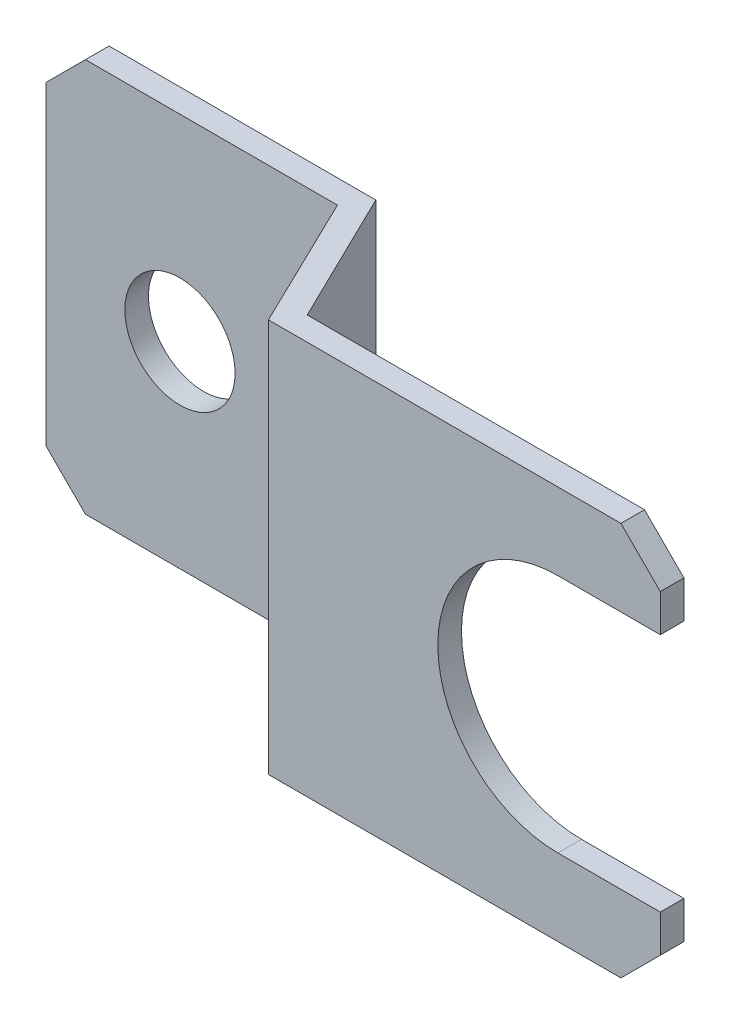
ISO-10303-21;
HEADER;
FILE_DESCRIPTION(('STEP AP214'),'2;1');
FILE_NAME('part.step','',(''),(''),'','','');
FILE_SCHEMA(('AUTOMOTIVE_DESIGN { 1 0 10303 214 1 1 1 1 }'));
ENDSEC;
DATA;
#1=APPLICATION_CONTEXT('core data for automotive mechanical design processes');
#2=APPLICATION_PROTOCOL_DEFINITION('international standard','automotive_design',2000,#1);
#3=PRODUCT_CONTEXT('',#1,'mechanical');
#4=PRODUCT('Part','Part','',(#3));
#5=PRODUCT_RELATED_PRODUCT_CATEGORY('part','',(#4));
#6=PRODUCT_DEFINITION_FORMATION('','',#4);
#7=PRODUCT_DEFINITION_CONTEXT('part definition',#1,'design');
#8=PRODUCT_DEFINITION('design','',#6,#7);
#9=PRODUCT_DEFINITION_SHAPE('','',#8);
#10=(LENGTH_UNIT() NAMED_UNIT(*) SI_UNIT(.MILLI.,.METRE.));
#11=(NAMED_UNIT(*) PLANE_ANGLE_UNIT() SI_UNIT($,.RADIAN.));
#12=(NAMED_UNIT(*) SI_UNIT($,.STERADIAN.) SOLID_ANGLE_UNIT());
#13=UNCERTAINTY_MEASURE_WITH_UNIT(LENGTH_MEASURE(1.E-05),#10,'distance_accuracy_value','');
#14=(GEOMETRIC_REPRESENTATION_CONTEXT(3) GLOBAL_UNCERTAINTY_ASSIGNED_CONTEXT((#13)) GLOBAL_UNIT_ASSIGNED_CONTEXT((#10,
#11,#12)) REPRESENTATION_CONTEXT('',''));
#15=CARTESIAN_POINT('',(0.,0.,0.));
#16=DIRECTION('',(0.,0.,1.));
#17=DIRECTION('',(1.,0.,0.));
#18=AXIS2_PLACEMENT_3D('',#15,#16,#17);
#19=CARTESIAN_POINT('',(78.,-25.,20.));
#20=DIRECTION('',(-1.,0.,0.));
#21=DIRECTION('',(0.,-1.,0.));
#22=AXIS2_PLACEMENT_3D('',#19,#20,#21);
#23=PLANE('',#22);
#24=DIRECTION('',(0.,1.,0.));
#25=VECTOR('',#24,1.);
#26=CARTESIAN_POINT('',(78.,-25.,17.));
#27=LINE('',#26,#25);
#28=CARTESIAN_POINT('',(78.,15.25,17.));
#29=VERTEX_POINT('',#28);
#30=CARTESIAN_POINT('',(78.,20.,17.));
#31=VERTEX_POINT('',#30);
#32=EDGE_CURVE('E219',#29,#31,#27,.T.);
#33=ORIENTED_EDGE('',*,*,#32,.T.);
#34=DIRECTION('',(0.,0.,1.));
#35=VECTOR('',#34,1.);
#36=CARTESIAN_POINT('',(78.,20.,-30.));
#37=LINE('',#36,#35);
#38=CARTESIAN_POINT('',(78.,20.,20.));
#39=VERTEX_POINT('',#38);
#40=EDGE_CURVE('E246',#31,#39,#37,.T.);
#41=ORIENTED_EDGE('',*,*,#40,.T.);
#42=DIRECTION('',(0.,1.,0.));
#43=VECTOR('',#42,1.);
#44=CARTESIAN_POINT('',(78.,-25.,20.));
#45=LINE('',#44,#43);
#46=CARTESIAN_POINT('',(78.,15.25,20.));
#47=VERTEX_POINT('',#46);
#48=EDGE_CURVE('E203',#47,#39,#45,.T.);
#49=ORIENTED_EDGE('',*,*,#48,.F.);
#50=DIRECTION('',(0.,0.,-1.));
#51=VECTOR('',#50,1.);
#52=CARTESIAN_POINT('',(78.,15.25,20.));
#53=LINE('',#52,#51);
#54=EDGE_CURVE('E165',#47,#29,#53,.T.);
#55=ORIENTED_EDGE('',*,*,#54,.T.);
#56=EDGE_LOOP('',(#33,#41,#49,#55));
#57=FACE_BOUND('',#56,.T.);
#58=ADVANCED_FACE('F14',(#57),#23,.F.);
#59=CARTESIAN_POINT('',(78.,-25.,20.));
#60=DIRECTION('',(0.,0.,-1.));
#61=DIRECTION('',(-1.,0.,0.));
#62=AXIS2_PLACEMENT_3D('',#59,#60,#61);
#63=PLANE('',#62);
#64=ORIENTED_EDGE('',*,*,#48,.T.);
#65=DIRECTION('',(0.707106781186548,-0.707106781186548,0.));
#66=VECTOR('',#65,1.);
#67=CARTESIAN_POINT('',(78.,20.,20.));
#68=LINE('',#67,#66);
#69=CARTESIAN_POINT('',(73.,25.,20.));
#70=VERTEX_POINT('',#69);
#71=EDGE_CURVE('E185',#70,#39,#68,.T.);
#72=ORIENTED_EDGE('',*,*,#71,.F.);
#73=DIRECTION('',(-1.,0.,0.));
#74=VECTOR('',#73,1.);
#75=CARTESIAN_POINT('',(78.,25.,20.));
#76=LINE('',#75,#74);
#77=CARTESIAN_POINT('',(28.237343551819,25.,20.));
#78=VERTEX_POINT('',#77);
#79=EDGE_CURVE('E204',#70,#78,#76,.T.);
#80=ORIENTED_EDGE('',*,*,#79,.T.);
#81=DIRECTION('',(0.,1.,0.));
#82=VECTOR('',#81,1.);
#83=CARTESIAN_POINT('',(28.237343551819,-25.,20.));
#84=LINE('',#83,#82);
#85=CARTESIAN_POINT('',(28.237343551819,-25.,20.));
#86=VERTEX_POINT('',#85);
#87=EDGE_CURVE('E154',#86,#78,#84,.T.);
#88=ORIENTED_EDGE('',*,*,#87,.F.);
#89=DIRECTION('',(-1.,0.,0.));
#90=VECTOR('',#89,1.);
#91=CARTESIAN_POINT('',(78.,-25.,20.));
#92=LINE('',#91,#90);
#93=CARTESIAN_POINT('',(73.,-25.,20.));
#94=VERTEX_POINT('',#93);
#95=EDGE_CURVE('E195',#94,#86,#92,.T.);
#96=ORIENTED_EDGE('',*,*,#95,.F.);
#97=DIRECTION('',(-0.707106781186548,-0.707106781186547,0.));
#98=VECTOR('',#97,1.);
#99=CARTESIAN_POINT('',(78.,-20.,20.));
#100=LINE('',#99,#98);
#101=CARTESIAN_POINT('',(78.,-20.,20.));
#102=VERTEX_POINT('',#101);
#103=EDGE_CURVE('E252',#102,#94,#100,.T.);
#104=ORIENTED_EDGE('',*,*,#103,.F.);
#105=CARTESIAN_POINT('',(78.,-15.25,20.));
#106=VERTEX_POINT('',#105);
#107=EDGE_CURVE('E217',#102,#106,#45,.T.);
#108=ORIENTED_EDGE('',*,*,#107,.T.);
#109=DIRECTION('',(-1.,0.,0.));
#110=VECTOR('',#109,1.);
#111=CARTESIAN_POINT('',(78.,-15.25,20.));
#112=LINE('',#111,#110);
#113=CARTESIAN_POINT('',(65.,-15.25,20.));
#114=VERTEX_POINT('',#113);
#115=EDGE_CURVE('E267',#106,#114,#112,.T.);
#116=ORIENTED_EDGE('',*,*,#115,.T.);
#117=CARTESIAN_POINT('',(65.,0.,20.));
#118=DIRECTION('',(0.,0.,-1.));
#119=DIRECTION('',(-1.,0.,0.));
#120=AXIS2_PLACEMENT_3D('',#117,#118,#119);
#121=CIRCLE('',#120,15.25);
#122=CARTESIAN_POINT('',(65.,15.25,20.));
#123=VERTEX_POINT('',#122);
#124=EDGE_CURVE('E162',#114,#123,#121,.T.);
#125=ORIENTED_EDGE('',*,*,#124,.T.);
#126=DIRECTION('',(1.,0.,0.));
#127=VECTOR('',#126,1.);
#128=CARTESIAN_POINT('',(78.,15.25,20.));
#129=LINE('',#128,#127);
#130=EDGE_CURVE('E273',#123,#47,#129,.T.);
#131=ORIENTED_EDGE('',*,*,#130,.T.);
#132=EDGE_LOOP('',(#64,#72,#80,#88,#96,#104,#108,#116,#125,#131));
#133=FACE_BOUND('',#132,.T.);
#134=ADVANCED_FACE('F16',(#133),#63,.F.);
#135=CARTESIAN_POINT('',(28.237343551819,-25.,20.));
#136=DIRECTION('',(0.899919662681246,0.,-0.436055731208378));
#137=DIRECTION('',(-0.436055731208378,0.,-0.899919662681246));
#138=AXIS2_PLACEMENT_3D('',#135,#136,#137);
#139=PLANE('',#138);
#140=DIRECTION('',(-0.436055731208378,0.,-0.899919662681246));
#141=VECTOR('',#140,1.);
#142=CARTESIAN_POINT('',(28.237343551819,25.,20.));
#143=LINE('',#142,#141);
#144=CARTESIAN_POINT('',(20.,25.,3.));
#145=VERTEX_POINT('',#144);
#146=EDGE_CURVE('E206',#78,#145,#143,.T.);
#147=ORIENTED_EDGE('',*,*,#146,.T.);
#148=DIRECTION('',(0.,1.,0.));
#149=VECTOR('',#148,1.);
#150=CARTESIAN_POINT('',(20.,-25.,3.));
#151=LINE('',#150,#149);
#152=CARTESIAN_POINT('',(20.,-25.,3.));
#153=VERTEX_POINT('',#152);
#154=EDGE_CURVE('E145',#153,#145,#151,.T.);
#155=ORIENTED_EDGE('',*,*,#154,.F.);
#156=DIRECTION('',(-0.436055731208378,0.,-0.899919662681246));
#157=VECTOR('',#156,1.);
#158=CARTESIAN_POINT('',(28.237343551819,-25.,20.));
#159=LINE('',#158,#157);
#160=EDGE_CURVE('E189',#86,#153,#159,.T.);
#161=ORIENTED_EDGE('',*,*,#160,.F.);
#162=ORIENTED_EDGE('',*,*,#87,.T.);
#163=EDGE_LOOP('',(#147,#155,#161,#162));
#164=FACE_BOUND('',#163,.T.);
#165=ADVANCED_FACE('F282',(#164),#139,.F.);
#166=CARTESIAN_POINT('',(20.,-25.,3.));
#167=DIRECTION('',(0.,0.,-1.));
#168=DIRECTION('',(-1.,0.,0.));
#169=AXIS2_PLACEMENT_3D('',#166,#167,#168);
#170=PLANE('',#169);
#171=CARTESIAN_POINT('',(0.,0.,3.));
#172=DIRECTION('',(0.,0.,-1.));
#173=DIRECTION('',(-1.,0.,0.));
#174=AXIS2_PLACEMENT_3D('',#171,#172,#173);
#175=CIRCLE('',#174,7.);
#176=CARTESIAN_POINT('',(-7.,0.,3.));
#177=VERTEX_POINT('',#176);
#178=EDGE_CURVE('E161',#177,#177,#175,.T.);
#179=ORIENTED_EDGE('',*,*,#178,.T.);
#180=EDGE_LOOP('',(#179));
#181=FACE_BOUND('',#180,.T.);
#182=DIRECTION('',(-1.,0.,0.));
#183=VECTOR('',#182,1.);
#184=CARTESIAN_POINT('',(20.,25.,3.));
#185=LINE('',#184,#183);
#186=CARTESIAN_POINT('',(-12.,25.,3.));
#187=VERTEX_POINT('',#186);
#188=EDGE_CURVE('E208',#145,#187,#185,.T.);
#189=ORIENTED_EDGE('',*,*,#188,.T.);
#190=DIRECTION('',(-0.707106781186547,-0.707106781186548,0.));
#191=VECTOR('',#190,1.);
#192=CARTESIAN_POINT('',(-21.,16.,3.));
#193=LINE('',#192,#191);
#194=CARTESIAN_POINT('',(-17.,20.,3.));
#195=VERTEX_POINT('',#194);
#196=EDGE_CURVE('E29',#187,#195,#193,.T.);
#197=ORIENTED_EDGE('',*,*,#196,.T.);
#198=DIRECTION('',(0.,1.,0.));
#199=VECTOR('',#198,1.);
#200=CARTESIAN_POINT('',(-17.,-25.,3.));
#201=LINE('',#200,#199);
#202=CARTESIAN_POINT('',(-17.,-20.,3.));
#203=VERTEX_POINT('',#202);
#204=EDGE_CURVE('E139',#203,#195,#201,.T.);
#205=ORIENTED_EDGE('',*,*,#204,.F.);
#206=DIRECTION('',(0.707106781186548,-0.707106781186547,0.));
#207=VECTOR('',#206,1.);
#208=CARTESIAN_POINT('',(4.,-41.,3.));
#209=LINE('',#208,#207);
#210=CARTESIAN_POINT('',(-12.,-25.,3.));
#211=VERTEX_POINT('',#210);
#212=EDGE_CURVE('E177',#203,#211,#209,.T.);
#213=ORIENTED_EDGE('',*,*,#212,.T.);
#214=DIRECTION('',(-1.,0.,0.));
#215=VECTOR('',#214,1.);
#216=CARTESIAN_POINT('',(20.,-25.,3.));
#217=LINE('',#216,#215);
#218=EDGE_CURVE('E184',#153,#211,#217,.T.);
#219=ORIENTED_EDGE('',*,*,#218,.F.);
#220=ORIENTED_EDGE('',*,*,#154,.T.);
#221=EDGE_LOOP('',(#189,#197,#205,#213,#219,#220));
#222=FACE_BOUND('',#221,.T.);
#223=ADVANCED_FACE('F183',(#181,#222),#170,.F.);
#224=CARTESIAN_POINT('',(-17.,-25.,3.));
#225=DIRECTION('',(1.,0.,0.));
#226=DIRECTION('',(0.,1.,0.));
#227=AXIS2_PLACEMENT_3D('',#224,#225,#226);
#228=PLANE('',#227);
#229=ORIENTED_EDGE('',*,*,#204,.T.);
#230=DIRECTION('',(0.,0.,1.));
#231=VECTOR('',#230,1.);
#232=CARTESIAN_POINT('',(-17.,20.,-30.));
#233=LINE('',#232,#231);
#234=CARTESIAN_POINT('',(-17.,20.,0.));
#235=VERTEX_POINT('',#234);
#236=EDGE_CURVE('E127',#235,#195,#233,.T.);
#237=ORIENTED_EDGE('',*,*,#236,.F.);
#238=DIRECTION('',(0.,1.,0.));
#239=VECTOR('',#238,1.);
#240=CARTESIAN_POINT('',(-17.,-25.,0.));
#241=LINE('',#240,#239);
#242=CARTESIAN_POINT('',(-17.,-20.,0.));
#243=VERTEX_POINT('',#242);
#244=EDGE_CURVE('E137',#243,#235,#241,.T.);
#245=ORIENTED_EDGE('',*,*,#244,.F.);
#246=DIRECTION('',(0.,0.,1.));
#247=VECTOR('',#246,1.);
#248=CARTESIAN_POINT('',(-17.,-20.,-30.));
#249=LINE('',#248,#247);
#250=EDGE_CURVE('E470',#243,#203,#249,.T.);
#251=ORIENTED_EDGE('',*,*,#250,.T.);
#252=EDGE_LOOP('',(#229,#237,#245,#251));
#253=FACE_BOUND('',#252,.T.);
#254=ADVANCED_FACE('F135',(#253),#228,.F.);
#255=CARTESIAN_POINT('',(21.8745969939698,-25.,0.));
#256=DIRECTION('',(0.,0.,1.));
#257=DIRECTION('',(1.,0.,0.));
#258=AXIS2_PLACEMENT_3D('',#255,#256,#257);
#259=PLANE('',#258);
#260=CARTESIAN_POINT('',(0.,0.,0.));
#261=DIRECTION('',(0.,0.,1.));
#262=DIRECTION('',(1.,0.,0.));
#263=AXIS2_PLACEMENT_3D('',#260,#261,#262);
#264=CIRCLE('',#263,7.);
#265=CARTESIAN_POINT('',(7.,0.,0.));
#266=VERTEX_POINT('',#265);
#267=EDGE_CURVE('E158',#266,#266,#264,.T.);
#268=ORIENTED_EDGE('',*,*,#267,.T.);
#269=EDGE_LOOP('',(#268));
#270=FACE_BOUND('',#269,.T.);
#271=ORIENTED_EDGE('',*,*,#244,.T.);
#272=DIRECTION('',(0.707106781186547,0.707106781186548,0.));
#273=VECTOR('',#272,1.);
#274=CARTESIAN_POINT('',(-20.0627015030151,16.9372984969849,0.));
#275=LINE('',#274,#273);
#276=CARTESIAN_POINT('',(-12.,25.,0.));
#277=VERTEX_POINT('',#276);
#278=EDGE_CURVE('E124',#235,#277,#275,.T.);
#279=ORIENTED_EDGE('',*,*,#278,.T.);
#280=DIRECTION('',(1.,0.,0.));
#281=VECTOR('',#280,1.);
#282=CARTESIAN_POINT('',(21.8745969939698,25.,0.));
#283=LINE('',#282,#281);
#284=CARTESIAN_POINT('',(21.8745969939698,25.,0.));
#285=VERTEX_POINT('',#284);
#286=EDGE_CURVE('E210',#277,#285,#283,.T.);
#287=ORIENTED_EDGE('',*,*,#286,.T.);
#288=DIRECTION('',(0.,1.,0.));
#289=VECTOR('',#288,1.);
#290=CARTESIAN_POINT('',(21.8745969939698,-25.,0.));
#291=LINE('',#290,#289);
#292=CARTESIAN_POINT('',(21.8745969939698,-25.,0.));
#293=VERTEX_POINT('',#292);
#294=EDGE_CURVE('E143',#293,#285,#291,.T.);
#295=ORIENTED_EDGE('',*,*,#294,.F.);
#296=DIRECTION('',(1.,0.,0.));
#297=VECTOR('',#296,1.);
#298=CARTESIAN_POINT('',(21.8745969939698,-25.,0.));
#299=LINE('',#298,#297);
#300=CARTESIAN_POINT('',(-12.,-25.,0.));
#301=VERTEX_POINT('',#300);
#302=EDGE_CURVE('E191',#301,#293,#299,.T.);
#303=ORIENTED_EDGE('',*,*,#302,.F.);
#304=DIRECTION('',(-0.707106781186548,0.707106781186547,0.));
#305=VECTOR('',#304,1.);
#306=CARTESIAN_POINT('',(4.9372984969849,-41.9372984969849,0.));
#307=LINE('',#306,#305);
#308=EDGE_CURVE('E36',#301,#243,#307,.T.);
#309=ORIENTED_EDGE('',*,*,#308,.T.);
#310=EDGE_LOOP('',(#271,#279,#287,#295,#303,#309));
#311=FACE_BOUND('',#310,.T.);
#312=ADVANCED_FACE('F141',(#270,#311),#259,.F.);
#313=CARTESIAN_POINT('',(30.1660509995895,-25.,17.));
#314=DIRECTION('',(-0.898794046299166,0.,0.43837114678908));
#315=DIRECTION('',(0.43837114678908,0.,0.898794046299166));
#316=AXIS2_PLACEMENT_3D('',#313,#314,#315);
#317=PLANE('',#316);
#318=DIRECTION('',(0.43837114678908,0.,0.898794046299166));
#319=VECTOR('',#318,1.);
#320=CARTESIAN_POINT('',(30.1660509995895,25.,17.));
#321=LINE('',#320,#319);
#322=CARTESIAN_POINT('',(30.1660509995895,25.,17.));
#323=VERTEX_POINT('',#322);
#324=EDGE_CURVE('E212',#285,#323,#321,.T.);
#325=ORIENTED_EDGE('',*,*,#324,.T.);
#326=DIRECTION('',(0.,1.,0.));
#327=VECTOR('',#326,1.);
#328=CARTESIAN_POINT('',(30.1660509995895,-25.,17.));
#329=LINE('',#328,#327);
#330=CARTESIAN_POINT('',(30.1660509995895,-25.,17.));
#331=VERTEX_POINT('',#330);
#332=EDGE_CURVE('E148',#331,#323,#329,.T.);
#333=ORIENTED_EDGE('',*,*,#332,.F.);
#334=DIRECTION('',(0.43837114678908,0.,0.898794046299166));
#335=VECTOR('',#334,1.);
#336=CARTESIAN_POINT('',(30.1660509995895,-25.,17.));
#337=LINE('',#336,#335);
#338=EDGE_CURVE('E193',#293,#331,#337,.T.);
#339=ORIENTED_EDGE('',*,*,#338,.F.);
#340=ORIENTED_EDGE('',*,*,#294,.T.);
#341=EDGE_LOOP('',(#325,#333,#339,#340));
#342=FACE_BOUND('',#341,.T.);
#343=ADVANCED_FACE('F285',(#342),#317,.F.);
#344=CARTESIAN_POINT('',(78.,-25.,17.));
#345=DIRECTION('',(0.,0.,1.));
#346=DIRECTION('',(1.,0.,0.));
#347=AXIS2_PLACEMENT_3D('',#344,#345,#346);
#348=PLANE('',#347);
#349=DIRECTION('',(1.,0.,0.));
#350=VECTOR('',#349,1.);
#351=CARTESIAN_POINT('',(78.,25.,17.));
#352=LINE('',#351,#350);
#353=CARTESIAN_POINT('',(73.,25.,17.));
#354=VERTEX_POINT('',#353);
#355=EDGE_CURVE('E214',#323,#354,#352,.T.);
#356=ORIENTED_EDGE('',*,*,#355,.T.);
#357=DIRECTION('',(0.707106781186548,-0.707106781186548,0.));
#358=VECTOR('',#357,1.);
#359=CARTESIAN_POINT('',(100.5,-2.5,17.));
#360=LINE('',#359,#358);
#361=EDGE_CURVE('E240',#354,#31,#360,.T.);
#362=ORIENTED_EDGE('',*,*,#361,.T.);
#363=ORIENTED_EDGE('',*,*,#32,.F.);
#364=DIRECTION('',(-1.,0.,0.));
#365=VECTOR('',#364,1.);
#366=CARTESIAN_POINT('',(78.,15.25,17.));
#367=LINE('',#366,#365);
#368=CARTESIAN_POINT('',(65.,15.25,17.));
#369=VERTEX_POINT('',#368);
#370=EDGE_CURVE('E270',#29,#369,#367,.T.);
#371=ORIENTED_EDGE('',*,*,#370,.T.);
#372=CARTESIAN_POINT('',(65.,0.,17.));
#373=DIRECTION('',(0.,0.,1.));
#374=DIRECTION('',(1.,0.,0.));
#375=AXIS2_PLACEMENT_3D('',#372,#373,#374);
#376=CIRCLE('',#375,15.25);
#377=CARTESIAN_POINT('',(65.,-15.25,17.));
#378=VERTEX_POINT('',#377);
#379=EDGE_CURVE('E168',#369,#378,#376,.T.);
#380=ORIENTED_EDGE('',*,*,#379,.T.);
#381=DIRECTION('',(1.,0.,0.));
#382=VECTOR('',#381,1.);
#383=CARTESIAN_POINT('',(78.,-15.25,17.));
#384=LINE('',#383,#382);
#385=CARTESIAN_POINT('',(78.,-15.25,17.));
#386=VERTEX_POINT('',#385);
#387=EDGE_CURVE('E262',#378,#386,#384,.T.);
#388=ORIENTED_EDGE('',*,*,#387,.T.);
#389=CARTESIAN_POINT('',(78.,-20.,17.));
#390=VERTEX_POINT('',#389);
#391=EDGE_CURVE('E220',#390,#386,#27,.T.);
#392=ORIENTED_EDGE('',*,*,#391,.F.);
#393=DIRECTION('',(-0.707106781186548,-0.707106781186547,0.));
#394=VECTOR('',#393,1.);
#395=CARTESIAN_POINT('',(75.5,-22.5,17.));
#396=LINE('',#395,#394);
#397=CARTESIAN_POINT('',(73.,-25.,17.));
#398=VERTEX_POINT('',#397);
#399=EDGE_CURVE('E256',#390,#398,#396,.T.);
#400=ORIENTED_EDGE('',*,*,#399,.T.);
#401=DIRECTION('',(1.,0.,0.));
#402=VECTOR('',#401,1.);
#403=CARTESIAN_POINT('',(78.,-25.,17.));
#404=LINE('',#403,#402);
#405=EDGE_CURVE('E200',#331,#398,#404,.T.);
#406=ORIENTED_EDGE('',*,*,#405,.F.);
#407=ORIENTED_EDGE('',*,*,#332,.T.);
#408=EDGE_LOOP('',(#356,#362,#363,#371,#380,#388,#392,#400,#406,#407));
#409=FACE_BOUND('',#408,.T.);
#410=ADVANCED_FACE('F226',(#409),#348,.F.);
#411=ORIENTED_EDGE('',*,*,#107,.F.);
#412=DIRECTION('',(0.,0.,1.));
#413=VECTOR('',#412,1.);
#414=CARTESIAN_POINT('',(78.,-20.,-30.));
#415=LINE('',#414,#413);
#416=EDGE_CURVE('E254',#390,#102,#415,.T.);
#417=ORIENTED_EDGE('',*,*,#416,.F.);
#418=ORIENTED_EDGE('',*,*,#391,.T.);
#419=DIRECTION('',(0.,0.,1.));
#420=VECTOR('',#419,1.);
#421=CARTESIAN_POINT('',(78.,-15.25,20.));
#422=LINE('',#421,#420);
#423=EDGE_CURVE('E157',#386,#106,#422,.T.);
#424=ORIENTED_EDGE('',*,*,#423,.T.);
#425=EDGE_LOOP('',(#411,#417,#418,#424));
#426=FACE_BOUND('',#425,.T.);
#427=ADVANCED_FACE('F294',(#426),#23,.F.);
#428=CARTESIAN_POINT('',(-17.,-25.,0.));
#429=DIRECTION('',(0.,-1.,0.));
#430=DIRECTION('',(1.,0.,0.));
#431=AXIS2_PLACEMENT_3D('',#428,#429,#430);
#432=PLANE('',#431);
#433=DIRECTION('',(0.,0.,1.));
#434=VECTOR('',#433,1.);
#435=CARTESIAN_POINT('',(-12.,-25.,0.));
#436=LINE('',#435,#434);
#437=EDGE_CURVE('E22',#301,#211,#436,.T.);
#438=ORIENTED_EDGE('',*,*,#437,.F.);
#439=ORIENTED_EDGE('',*,*,#302,.T.);
#440=ORIENTED_EDGE('',*,*,#338,.T.);
#441=ORIENTED_EDGE('',*,*,#405,.T.);
#442=DIRECTION('',(0.,0.,-1.));
#443=VECTOR('',#442,1.);
#444=CARTESIAN_POINT('',(73.,-25.,0.));
#445=LINE('',#444,#443);
#446=EDGE_CURVE('E171',#94,#398,#445,.T.);
#447=ORIENTED_EDGE('',*,*,#446,.F.);
#448=ORIENTED_EDGE('',*,*,#95,.T.);
#449=ORIENTED_EDGE('',*,*,#160,.T.);
#450=ORIENTED_EDGE('',*,*,#218,.T.);
#451=EDGE_LOOP('',(#438,#439,#440,#441,#447,#448,#449,#450));
#452=FACE_BOUND('',#451,.T.);
#453=ADVANCED_FACE('F187',(#452),#432,.T.);
#454=CARTESIAN_POINT('',(-17.,25.,0.));
#455=DIRECTION('',(0.,-1.,0.));
#456=DIRECTION('',(1.,0.,0.));
#457=AXIS2_PLACEMENT_3D('',#454,#455,#456);
#458=PLANE('',#457);
#459=ORIENTED_EDGE('',*,*,#286,.F.);
#460=DIRECTION('',(0.,0.,1.));
#461=VECTOR('',#460,1.);
#462=CARTESIAN_POINT('',(-12.,25.,0.));
#463=LINE('',#462,#461);
#464=EDGE_CURVE('E9',#277,#187,#463,.T.);
#465=ORIENTED_EDGE('',*,*,#464,.T.);
#466=ORIENTED_EDGE('',*,*,#188,.F.);
#467=ORIENTED_EDGE('',*,*,#146,.F.);
#468=ORIENTED_EDGE('',*,*,#79,.F.);
#469=DIRECTION('',(0.,0.,-1.));
#470=VECTOR('',#469,1.);
#471=CARTESIAN_POINT('',(73.,25.,0.));
#472=LINE('',#471,#470);
#473=EDGE_CURVE('E173',#70,#354,#472,.T.);
#474=ORIENTED_EDGE('',*,*,#473,.T.);
#475=ORIENTED_EDGE('',*,*,#355,.F.);
#476=ORIENTED_EDGE('',*,*,#324,.F.);
#477=EDGE_LOOP('',(#459,#465,#466,#467,#468,#474,#475,#476));
#478=FACE_BOUND('',#477,.T.);
#479=ADVANCED_FACE('F233',(#478),#458,.F.);
#480=CARTESIAN_POINT('',(0.,0.,-22.));
#481=DIRECTION('',(0.,0.,1.));
#482=DIRECTION('',(1.,0.,0.));
#483=AXIS2_PLACEMENT_3D('',#480,#481,#482);
#484=CYLINDRICAL_SURFACE('',#483,7.);
#485=ORIENTED_EDGE('',*,*,#267,.F.);
#486=EDGE_LOOP('',(#485));
#487=FACE_BOUND('',#486,.T.);
#488=ORIENTED_EDGE('',*,*,#178,.F.);
#489=EDGE_LOOP('',(#488));
#490=FACE_BOUND('',#489,.T.);
#491=ADVANCED_FACE('F337',(#487,#490),#484,.F.);
#492=CARTESIAN_POINT('',(65.,0.,-22.));
#493=DIRECTION('',(0.,0.,1.));
#494=DIRECTION('',(1.,0.,0.));
#495=AXIS2_PLACEMENT_3D('',#492,#493,#494);
#496=CYLINDRICAL_SURFACE('',#495,15.25);
#497=DIRECTION('',(0.,0.,1.));
#498=VECTOR('',#497,1.);
#499=CARTESIAN_POINT('',(65.,-15.25,-22.));
#500=LINE('',#499,#498);
#501=EDGE_CURVE('E258',#378,#114,#500,.T.);
#502=ORIENTED_EDGE('',*,*,#501,.F.);
#503=ORIENTED_EDGE('',*,*,#379,.F.);
#504=DIRECTION('',(0.,0.,1.));
#505=VECTOR('',#504,1.);
#506=CARTESIAN_POINT('',(65.,15.25,-22.));
#507=LINE('',#506,#505);
#508=EDGE_CURVE('E259',#369,#123,#507,.T.);
#509=ORIENTED_EDGE('',*,*,#508,.T.);
#510=ORIENTED_EDGE('',*,*,#124,.F.);
#511=EDGE_LOOP('',(#502,#503,#509,#510));
#512=FACE_BOUND('',#511,.T.);
#513=ADVANCED_FACE('F323',(#512),#496,.F.);
#514=CARTESIAN_POINT('',(86.1837482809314,15.25,-22.));
#515=DIRECTION('',(0.,1.,0.));
#516=DIRECTION('',(-1.,0.,0.));
#517=AXIS2_PLACEMENT_3D('',#514,#515,#516);
#518=PLANE('',#517);
#519=ORIENTED_EDGE('',*,*,#508,.F.);
#520=ORIENTED_EDGE('',*,*,#370,.F.);
#521=ORIENTED_EDGE('',*,*,#54,.F.);
#522=ORIENTED_EDGE('',*,*,#130,.F.);
#523=EDGE_LOOP('',(#519,#520,#521,#522));
#524=FACE_BOUND('',#523,.T.);
#525=ADVANCED_FACE('F327',(#524),#518,.F.);
#526=CARTESIAN_POINT('',(65.,-15.25,-22.));
#527=DIRECTION('',(0.,-1.,0.));
#528=DIRECTION('',(1.,0.,0.));
#529=AXIS2_PLACEMENT_3D('',#526,#527,#528);
#530=PLANE('',#529);
#531=ORIENTED_EDGE('',*,*,#423,.F.);
#532=ORIENTED_EDGE('',*,*,#387,.F.);
#533=ORIENTED_EDGE('',*,*,#501,.T.);
#534=ORIENTED_EDGE('',*,*,#115,.F.);
#535=EDGE_LOOP('',(#531,#532,#533,#534));
#536=FACE_BOUND('',#535,.T.);
#537=ADVANCED_FACE('F320',(#536),#530,.F.);
#538=CARTESIAN_POINT('',(78.,-20.,-30.));
#539=DIRECTION('',(-0.707106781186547,0.707106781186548,0.));
#540=DIRECTION('',(-0.707106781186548,-0.707106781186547,0.));
#541=AXIS2_PLACEMENT_3D('',#538,#539,#540);
#542=PLANE('',#541);
#543=ORIENTED_EDGE('',*,*,#416,.T.);
#544=ORIENTED_EDGE('',*,*,#103,.T.);
#545=ORIENTED_EDGE('',*,*,#446,.T.);
#546=ORIENTED_EDGE('',*,*,#399,.F.);
#547=EDGE_LOOP('',(#543,#544,#545,#546));
#548=FACE_BOUND('',#547,.T.);
#549=ADVANCED_FACE('F335',(#548),#542,.F.);
#550=CARTESIAN_POINT('',(78.,20.,-30.));
#551=DIRECTION('',(-0.707106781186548,-0.707106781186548,0.));
#552=DIRECTION('',(0.707106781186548,-0.707106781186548,0.));
#553=AXIS2_PLACEMENT_3D('',#550,#551,#552);
#554=PLANE('',#553);
#555=ORIENTED_EDGE('',*,*,#473,.F.);
#556=ORIENTED_EDGE('',*,*,#71,.T.);
#557=ORIENTED_EDGE('',*,*,#40,.F.);
#558=ORIENTED_EDGE('',*,*,#361,.F.);
#559=EDGE_LOOP('',(#555,#556,#557,#558));
#560=FACE_BOUND('',#559,.T.);
#561=ADVANCED_FACE('F238',(#560),#554,.F.);
#562=CARTESIAN_POINT('',(-17.,-20.,-30.));
#563=DIRECTION('',(0.707106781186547,0.707106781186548,0.));
#564=DIRECTION('',(-0.707106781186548,0.707106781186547,0.));
#565=AXIS2_PLACEMENT_3D('',#562,#563,#564);
#566=PLANE('',#565);
#567=ORIENTED_EDGE('',*,*,#250,.F.);
#568=ORIENTED_EDGE('',*,*,#308,.F.);
#569=ORIENTED_EDGE('',*,*,#437,.T.);
#570=ORIENTED_EDGE('',*,*,#212,.F.);
#571=EDGE_LOOP('',(#567,#568,#569,#570));
#572=FACE_BOUND('',#571,.T.);
#573=ADVANCED_FACE('F176',(#572),#566,.F.);
#574=CARTESIAN_POINT('',(-17.,20.,-30.));
#575=DIRECTION('',(0.707106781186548,-0.707106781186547,0.));
#576=DIRECTION('',(0.707106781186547,0.707106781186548,0.));
#577=AXIS2_PLACEMENT_3D('',#574,#575,#576);
#578=PLANE('',#577);
#579=ORIENTED_EDGE('',*,*,#464,.F.);
#580=ORIENTED_EDGE('',*,*,#278,.F.);
#581=ORIENTED_EDGE('',*,*,#236,.T.);
#582=ORIENTED_EDGE('',*,*,#196,.F.);
#583=EDGE_LOOP('',(#579,#580,#581,#582));
#584=FACE_BOUND('',#583,.T.);
#585=ADVANCED_FACE('F126',(#584),#578,.F.);
#586=CLOSED_SHELL('',(#58,#134,#165,#223,#254,#312,#343,#410,#427,#453,#479,#491,#513,#525,#537,
#549,#561,#573,#585));
#587=MANIFOLD_SOLID_BREP('B1',#586);
#588=ADVANCED_BREP_SHAPE_REPRESENTATION('',(#18,#587),#14);
#589=SHAPE_DEFINITION_REPRESENTATION(#9,#588);
ENDSEC;
END-ISO-10303-21;
